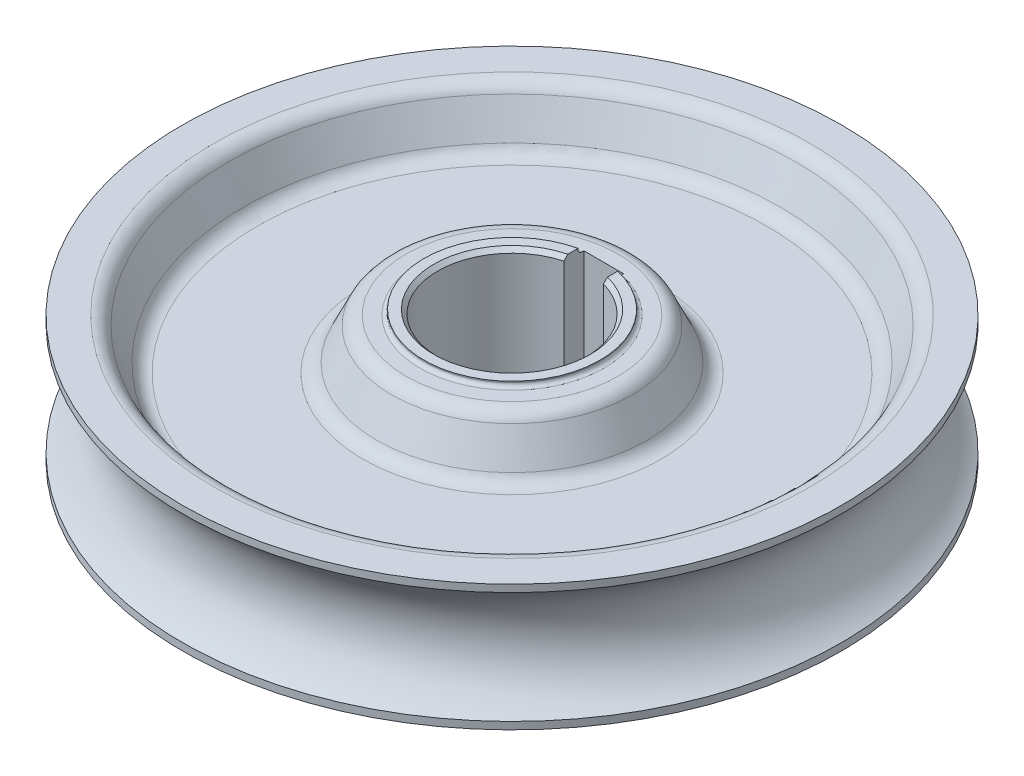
ISO-10303-21;
HEADER;
FILE_DESCRIPTION(('STEP AP214'),'2;1');
FILE_NAME('part.step','',(''),(''),'','','');
FILE_SCHEMA(('AUTOMOTIVE_DESIGN { 1 0 10303 214 1 1 1 1 }'));
ENDSEC;
DATA;
#1=APPLICATION_CONTEXT('core data for automotive mechanical design processes');
#2=APPLICATION_PROTOCOL_DEFINITION('international standard','automotive_design',2000,#1);
#3=PRODUCT_CONTEXT('',#1,'mechanical');
#4=PRODUCT('Part','Part','',(#3));
#5=PRODUCT_RELATED_PRODUCT_CATEGORY('part','',(#4));
#6=PRODUCT_DEFINITION_FORMATION('','',#4);
#7=PRODUCT_DEFINITION_CONTEXT('part definition',#1,'design');
#8=PRODUCT_DEFINITION('design','',#6,#7);
#9=PRODUCT_DEFINITION_SHAPE('','',#8);
#10=(LENGTH_UNIT() NAMED_UNIT(*) SI_UNIT(.MILLI.,.METRE.));
#11=(NAMED_UNIT(*) PLANE_ANGLE_UNIT() SI_UNIT($,.RADIAN.));
#12=(NAMED_UNIT(*) SI_UNIT($,.STERADIAN.) SOLID_ANGLE_UNIT());
#13=UNCERTAINTY_MEASURE_WITH_UNIT(LENGTH_MEASURE(1.E-05),#10,'distance_accuracy_value','');
#14=(GEOMETRIC_REPRESENTATION_CONTEXT(3) GLOBAL_UNCERTAINTY_ASSIGNED_CONTEXT((#13)) GLOBAL_UNIT_ASSIGNED_CONTEXT((#10,
#11,#12)) REPRESENTATION_CONTEXT('',''));
#15=CARTESIAN_POINT('',(0.,0.,0.));
#16=DIRECTION('',(0.,0.,1.));
#17=DIRECTION('',(1.,0.,0.));
#18=AXIS2_PLACEMENT_3D('',#15,#16,#17);
#19=CARTESIAN_POINT('',(-4.,-13.75,-18.5));
#20=DIRECTION('',(-1.,0.,0.));
#21=DIRECTION('',(0.,0.,1.));
#22=AXIS2_PLACEMENT_3D('',#19,#20,#21);
#23=PLANE('',#22);
#24=DIRECTION('',(0.,0.,-1.));
#25=VECTOR('',#24,1.);
#26=CARTESIAN_POINT('',(-4.,12.734,-18.5));
#27=LINE('',#26,#25);
#28=CARTESIAN_POINT('',(-4.,12.734,-18.1379212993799));
#29=VERTEX_POINT('',#28);
#30=CARTESIAN_POINT('',(-4.,12.734,-18.5));
#31=VERTEX_POINT('',#30);
#32=EDGE_CURVE('E397',#29,#31,#27,.T.);
#33=ORIENTED_EDGE('',*,*,#32,.F.);
#34=CARTESIAN_POINT('',(-4.,12.734,-18.1379212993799));
#35=CARTESIAN_POINT('',(-4.,12.7339661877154,-18.0913173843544));
#36=CARTESIAN_POINT('',(-4.,12.7379122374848,-18.0447197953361));
#37=CARTESIAN_POINT('',(-4.,12.7535123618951,-17.9528377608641));
#38=CARTESIAN_POINT('',(-4.,12.765165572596,-17.9075531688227));
#39=CARTESIAN_POINT('',(-4.,12.7959387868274,-17.8195569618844));
#40=CARTESIAN_POINT('',(-4.,12.8150638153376,-17.7768471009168));
#41=CARTESIAN_POINT('',(-4.,12.860277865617,-17.6953022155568));
#42=CARTESIAN_POINT('',(-4.,12.8863644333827,-17.6564658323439));
#43=CARTESIAN_POINT('',(-4.,12.9445144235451,-17.5842215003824));
#44=CARTESIAN_POINT('',(-4.,12.9765128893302,-17.5507613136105));
#45=CARTESIAN_POINT('',(-4.,13.0458027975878,-17.4898377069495));
#46=CARTESIAN_POINT('',(-4.,13.0830949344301,-17.4623750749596));
#47=CARTESIAN_POINT('',(-4.,13.1609716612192,-17.4149301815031));
#48=CARTESIAN_POINT('',(-4.,13.2014592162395,-17.3947884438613));
#49=CARTESIAN_POINT('',(-4.,13.285282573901,-17.3617872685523));
#50=CARTESIAN_POINT('',(-4.,13.3286155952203,-17.3489208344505));
#51=CARTESIAN_POINT('',(-4.,13.3982148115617,-17.3346902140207));
#52=CARTESIAN_POINT('',(-4.,13.4239832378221,-17.3307639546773));
#53=CARTESIAN_POINT('',(-4.,13.4757468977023,-17.3255268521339));
#54=CARTESIAN_POINT('',(-4.,13.5017417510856,-17.3242122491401));
#55=CARTESIAN_POINT('',(-4.,13.52775,-17.3242142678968));
#56=B_SPLINE_CURVE_WITH_KNOTS('',3,(#34,#35,#36,#37,#38,#39,#40,#41,#42,#43,#44,#45,#46,#47,#48,
#49,#50,#51,#52,#53,#54,#55),.UNSPECIFIED.,.F.,.F.,(4,2,2,2,2,2,2,2,2,2,4),(0.,
0.139637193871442,0.27925873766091,0.418974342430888,0.558640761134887,0.69685516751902,
0.835087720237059,0.970097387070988,1.10497699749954,1.18305483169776,1.26102018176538),.UNSPECIFIED.);
#57=CARTESIAN_POINT('',(-4.,13.52775,-17.3242142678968));
#58=VERTEX_POINT('',#57);
#59=EDGE_CURVE('E49',#29,#58,#56,.T.);
#60=ORIENTED_EDGE('',*,*,#59,.T.);
#61=DIRECTION('',(0.,1.,0.));
#62=VECTOR('',#61,1.);
#63=CARTESIAN_POINT('',(-4.,12.734,-17.3242142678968));
#64=LINE('',#63,#62);
#65=CARTESIAN_POINT('',(-4.,13.75,-17.3242142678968));
#66=VERTEX_POINT('',#65);
#67=EDGE_CURVE('E125',#58,#66,#64,.T.);
#68=ORIENTED_EDGE('',*,*,#67,.T.);
#69=DIRECTION('',(0.,0.,1.));
#70=VECTOR('',#69,1.);
#71=CARTESIAN_POINT('',(-4.,13.75,-18.5));
#72=LINE('',#71,#70);
#73=CARTESIAN_POINT('',(-4.,13.75,-15.2788264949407));
#74=VERTEX_POINT('',#73);
#75=EDGE_CURVE('E128',#66,#74,#72,.T.);
#76=ORIENTED_EDGE('',*,*,#75,.T.);
#77=CARTESIAN_POINT('',(-4.,25.0227829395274,-26.7693333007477));
#78=CARTESIAN_POINT('',(-4.,24.5122049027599,-26.2530825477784));
#79=CARTESIAN_POINT('',(-4.,24.0017855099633,-25.7366748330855));
#80=CARTESIAN_POINT('',(-4.,22.9813373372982,-24.7034730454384));
#81=CARTESIAN_POINT('',(-4.,22.4713085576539,-24.1866789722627));
#82=CARTESIAN_POINT('',(-4.,20.9419211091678,-22.6356115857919));
#83=CARTESIAN_POINT('',(-4.,19.9232592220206,-21.6006509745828));
#84=CARTESIAN_POINT('',(-4.,17.8889397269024,-19.5282290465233));
#85=CARTESIAN_POINT('',(-4.,16.8732815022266,-18.4907683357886));
#86=CARTESIAN_POINT('',(-4.,15.3531976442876,-16.9312449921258));
#87=CARTESIAN_POINT('',(-4.,14.847066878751,-16.410844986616));
#88=CARTESIAN_POINT('',(-4.,13.8363247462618,-15.368571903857));
#89=CARTESIAN_POINT('',(-4.,13.3317133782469,-14.8466988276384));
#90=CARTESIAN_POINT('',(-4.,12.2601311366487,-13.7341314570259));
#91=CARTESIAN_POINT('',(-4.,11.6934371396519,-13.1431700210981));
#92=CARTESIAN_POINT('',(-4.,10.8462733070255,-12.2540077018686));
#93=CARTESIAN_POINT('',(-4.,10.5643702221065,-11.95717257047));
#94=CARTESIAN_POINT('',(-4.,10.0017543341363,-11.3623729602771));
#95=CARTESIAN_POINT('',(-4.,9.72104153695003,-11.0644084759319));
#96=CARTESIAN_POINT('',(-4.,9.16106591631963,-10.4670305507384));
#97=CARTESIAN_POINT('',(-4.,8.88180332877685,-10.1676168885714));
#98=CARTESIAN_POINT('',(-4.,8.32519767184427,-9.56701695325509));
#99=CARTESIAN_POINT('',(-4.,8.04785457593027,-9.26583070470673));
#100=CARTESIAN_POINT('',(-4.,7.4956396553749,-8.66113040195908));
#101=CARTESIAN_POINT('',(-4.,7.22076812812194,-8.35761607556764));
#102=CARTESIAN_POINT('',(-4.,6.81099121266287,-7.90006510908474));
#103=CARTESIAN_POINT('',(-4.,6.67481745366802,-7.74716457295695));
#104=CARTESIAN_POINT('',(-4.,6.40347257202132,-7.44047340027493));
#105=CARTESIAN_POINT('',(-4.,6.26830146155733,-7.28668275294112));
#106=CARTESIAN_POINT('',(-4.,6.13371180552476,-7.13238260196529));
#107=B_SPLINE_CURVE_WITH_KNOTS('',3,(#77,#78,#79,#80,#81,#82,#83,#84,#85,#86,#87,#88,#89,#90,
#91,#92,#93,#94,#95,#96,#97,#98,#99,#100,#101,#102,#103,#104,#105,#106),.UNSPECIFIED.,.F.,.F.,
(4,2,2,2,2,2,2,2,2,2,2,2,2,2,4),(0.,2.17826605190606,4.35653335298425,8.71305896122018,
13.0686174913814,15.2464260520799,17.4242330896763,19.8805169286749,21.1086121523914,
22.3367134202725,23.5650085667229,24.7932867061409,26.0217107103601,26.6359516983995,
27.2502001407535),.UNSPECIFIED.);
#108=CARTESIAN_POINT('',(-4.,12.95625,-14.456832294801));
#109=VERTEX_POINT('',#108);
#110=EDGE_CURVE('E370',#74,#109,#107,.T.);
#111=ORIENTED_EDGE('',*,*,#110,.T.);
#112=DIRECTION('',(0.,-1.,0.));
#113=VECTOR('',#112,1.);
#114=CARTESIAN_POINT('',(-4.,0.,-14.456832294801));
#115=LINE('',#114,#113);
#116=CARTESIAN_POINT('',(-4.,-12.95625,-14.456832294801));
#117=VERTEX_POINT('',#116);
#118=EDGE_CURVE('E170',#109,#117,#115,.T.);
#119=ORIENTED_EDGE('',*,*,#118,.T.);
#120=CARTESIAN_POINT('',(-4.,-6.13371180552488,-7.13238260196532));
#121=CARTESIAN_POINT('',(-4.,-6.26830146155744,-7.28668275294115));
#122=CARTESIAN_POINT('',(-4.,-6.40347257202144,-7.44047340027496));
#123=CARTESIAN_POINT('',(-4.,-6.67481745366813,-7.74716457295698));
#124=CARTESIAN_POINT('',(-4.,-6.81099121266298,-7.90006510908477));
#125=CARTESIAN_POINT('',(-4.,-7.22076812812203,-8.35761607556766));
#126=CARTESIAN_POINT('',(-4.,-7.49563965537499,-8.6611304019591));
#127=CARTESIAN_POINT('',(-4.,-8.04785457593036,-9.26583070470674));
#128=CARTESIAN_POINT('',(-4.,-8.32519767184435,-9.5670169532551));
#129=CARTESIAN_POINT('',(-4.,-8.88180332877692,-10.1676168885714));
#130=CARTESIAN_POINT('',(-4.,-9.1610659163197,-10.4670305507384));
#131=CARTESIAN_POINT('',(-4.,-9.72104153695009,-11.0644084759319));
#132=CARTESIAN_POINT('',(-4.,-10.0017543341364,-11.3623729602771));
#133=CARTESIAN_POINT('',(-4.,-10.5643702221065,-11.95717257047));
#134=CARTESIAN_POINT('',(-4.,-10.8462733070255,-12.2540077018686));
#135=CARTESIAN_POINT('',(-4.,-11.6934371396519,-13.1431700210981));
#136=CARTESIAN_POINT('',(-4.,-12.2601311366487,-13.7341314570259));
#137=CARTESIAN_POINT('',(-4.,-13.3317133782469,-14.8466988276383));
#138=CARTESIAN_POINT('',(-4.,-13.8363247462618,-15.368571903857));
#139=CARTESIAN_POINT('',(-4.,-14.847066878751,-16.4108449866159));
#140=CARTESIAN_POINT('',(-4.,-15.3531976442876,-16.9312449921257));
#141=CARTESIAN_POINT('',(-4.,-16.8732815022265,-18.4907683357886));
#142=CARTESIAN_POINT('',(-4.,-17.8889397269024,-19.5282290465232));
#143=CARTESIAN_POINT('',(-4.,-19.9232592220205,-21.6006509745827));
#144=CARTESIAN_POINT('',(-4.,-20.9419211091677,-22.6356115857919));
#145=CARTESIAN_POINT('',(-4.,-22.4713085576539,-24.1866789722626));
#146=CARTESIAN_POINT('',(-4.,-22.9813373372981,-24.7034730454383));
#147=CARTESIAN_POINT('',(-4.,-24.0017855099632,-25.7366748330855));
#148=CARTESIAN_POINT('',(-4.,-24.5122049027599,-26.2530825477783));
#149=CARTESIAN_POINT('',(-4.,-25.0227829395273,-26.7693333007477));
#150=B_SPLINE_CURVE_WITH_KNOTS('',3,(#120,#121,#122,#123,#124,#125,#126,#127,#128,#129,#130,
#131,#132,#133,#134,#135,#136,#137,#138,#139,#140,#141,#142,#143,#144,#145,#146,#147,#148,#149),
.UNSPECIFIED.,.F.,.F.,(4,2,2,2,2,2,2,2,2,2,2,2,2,2,4),(0.,0.614248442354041,1.22848943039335,
2.45691343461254,3.68519157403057,4.9134867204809,6.14158798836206,7.36968321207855,
9.82596705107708,12.0037740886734,14.1815826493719,18.5371411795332,22.8936667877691,
25.0719340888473,27.2502001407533),.UNSPECIFIED.);
#151=CARTESIAN_POINT('',(-4.,-13.75,-15.2788264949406));
#152=VERTEX_POINT('',#151);
#153=EDGE_CURVE('E255',#117,#152,#150,.T.);
#154=ORIENTED_EDGE('',*,*,#153,.T.);
#155=DIRECTION('',(0.,0.,1.));
#156=VECTOR('',#155,1.);
#157=CARTESIAN_POINT('',(-4.,-13.75,-18.5));
#158=LINE('',#157,#156);
#159=CARTESIAN_POINT('',(-4.,-13.75,-17.3242142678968));
#160=VERTEX_POINT('',#159);
#161=EDGE_CURVE('E148',#160,#152,#158,.T.);
#162=ORIENTED_EDGE('',*,*,#161,.F.);
#163=DIRECTION('',(0.,-1.,0.));
#164=VECTOR('',#163,1.);
#165=CARTESIAN_POINT('',(-4.,-12.734,-17.3242142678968));
#166=LINE('',#165,#164);
#167=CARTESIAN_POINT('',(-4.,-13.52775,-17.3242142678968));
#168=VERTEX_POINT('',#167);
#169=EDGE_CURVE('E146',#168,#160,#166,.T.);
#170=ORIENTED_EDGE('',*,*,#169,.F.);
#171=CARTESIAN_POINT('',(-4.,-13.52775,-17.3242142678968));
#172=CARTESIAN_POINT('',(-4.,-13.4839109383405,-17.3241714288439));
#173=CARTESIAN_POINT('',(-4.,-13.4400902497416,-17.3279389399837));
#174=CARTESIAN_POINT('',(-4.,-13.3537674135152,-17.3427699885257));
#175=CARTESIAN_POINT('',(-4.,-13.3112633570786,-17.3538223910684));
#176=CARTESIAN_POINT('',(-4.,-13.2287054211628,-17.3829035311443));
#177=CARTESIAN_POINT('',(-4.,-13.1886520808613,-17.4009337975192));
#178=CARTESIAN_POINT('',(-4.,-13.1120939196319,-17.4433852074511));
#179=CARTESIAN_POINT('',(-4.,-13.0755892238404,-17.4678065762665));
#180=CARTESIAN_POINT('',(-4.,-13.0066909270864,-17.5226135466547));
#181=CARTESIAN_POINT('',(-4.,-12.9743488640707,-17.5530638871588));
#182=CARTESIAN_POINT('',(-4.,-12.9150841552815,-17.6188527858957));
#183=CARTESIAN_POINT('',(-4.,-12.8881628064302,-17.6541925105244));
#184=CARTESIAN_POINT('',(-4.,-12.8398186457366,-17.729664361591));
#185=CARTESIAN_POINT('',(-4.,-12.8185448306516,-17.7698918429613));
#186=CARTESIAN_POINT('',(-4.,-12.7828950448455,-17.8532900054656));
#187=CARTESIAN_POINT('',(-4.,-12.7685172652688,-17.8964599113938));
#188=CARTESIAN_POINT('',(-4.,-12.7498654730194,-17.9727929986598));
#189=CARTESIAN_POINT('',(-4.,-12.7439202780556,-18.0055587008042));
#190=CARTESIAN_POINT('',(-4.,-12.7359874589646,-18.0715197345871));
#191=CARTESIAN_POINT('',(-4.,-12.7339943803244,-18.104714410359));
#192=CARTESIAN_POINT('',(-4.,-12.734,-18.1379212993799));
#193=B_SPLINE_CURVE_WITH_KNOTS('',3,(#171,#172,#173,#174,#175,#176,#177,#178,#179,#180,#181,
#182,#183,#184,#185,#186,#187,#188,#189,#190,#191,#192),.UNSPECIFIED.,.F.,.F.,(4,2,2,2,2,2,2,2,
2,2,4),(0.,0.131327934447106,0.262455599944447,0.393612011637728,0.524773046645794,
0.657427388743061,0.790113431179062,0.926013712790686,1.0618783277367,1.16155334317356,
1.26109069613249),.UNSPECIFIED.);
#194=CARTESIAN_POINT('',(-4.,-12.734,-18.1379212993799));
#195=VERTEX_POINT('',#194);
#196=EDGE_CURVE('E203',#168,#195,#193,.T.);
#197=ORIENTED_EDGE('',*,*,#196,.T.);
#198=DIRECTION('',(0.,0.,1.));
#199=VECTOR('',#198,1.);
#200=CARTESIAN_POINT('',(-4.,-12.734,-18.5));
#201=LINE('',#200,#199);
#202=CARTESIAN_POINT('',(-4.,-12.734,-18.5));
#203=VERTEX_POINT('',#202);
#204=EDGE_CURVE('E322',#203,#195,#201,.T.);
#205=ORIENTED_EDGE('',*,*,#204,.F.);
#206=DIRECTION('',(0.,1.,0.));
#207=VECTOR('',#206,1.);
#208=CARTESIAN_POINT('',(-4.,-13.75,-18.5));
#209=LINE('',#208,#207);
#210=EDGE_CURVE('E156',#203,#31,#209,.T.);
#211=ORIENTED_EDGE('',*,*,#210,.T.);
#212=EDGE_LOOP('',(#33,#60,#68,#76,#111,#119,#154,#162,#170,#197,#205,#211));
#213=FACE_BOUND('',#212,.T.);
#214=ADVANCED_FACE('F36',(#213),#23,.F.);
#215=CARTESIAN_POINT('',(-4.,-13.75,-18.5));
#216=DIRECTION('',(0.,0.,-1.));
#217=DIRECTION('',(-1.,0.,0.));
#218=AXIS2_PLACEMENT_3D('',#215,#216,#217);
#219=PLANE('',#218);
#220=DIRECTION('',(1.,0.,0.));
#221=VECTOR('',#220,1.);
#222=CARTESIAN_POINT('',(-4.,12.734,-18.5));
#223=LINE('',#222,#221);
#224=CARTESIAN_POINT('',(4.,12.734,-18.5));
#225=VERTEX_POINT('',#224);
#226=EDGE_CURVE('E394',#31,#225,#223,.T.);
#227=ORIENTED_EDGE('',*,*,#226,.F.);
#228=ORIENTED_EDGE('',*,*,#210,.F.);
#229=DIRECTION('',(-1.,0.,0.));
#230=VECTOR('',#229,1.);
#231=CARTESIAN_POINT('',(-4.,-12.734,-18.5));
#232=LINE('',#231,#230);
#233=CARTESIAN_POINT('',(4.,-12.734,-18.5));
#234=VERTEX_POINT('',#233);
#235=EDGE_CURVE('E331',#234,#203,#232,.T.);
#236=ORIENTED_EDGE('',*,*,#235,.F.);
#237=DIRECTION('',(0.,1.,0.));
#238=VECTOR('',#237,1.);
#239=CARTESIAN_POINT('',(4.,-13.75,-18.5));
#240=LINE('',#239,#238);
#241=EDGE_CURVE('E160',#234,#225,#240,.T.);
#242=ORIENTED_EDGE('',*,*,#241,.T.);
#243=EDGE_LOOP('',(#227,#228,#236,#242));
#244=FACE_BOUND('',#243,.T.);
#245=ADVANCED_FACE('F182',(#244),#219,.F.);
#246=CARTESIAN_POINT('',(4.,-13.75,-18.5));
#247=DIRECTION('',(1.,0.,0.));
#248=DIRECTION('',(0.,0.,-1.));
#249=AXIS2_PLACEMENT_3D('',#246,#247,#248);
#250=PLANE('',#249);
#251=DIRECTION('',(0.,0.,1.));
#252=VECTOR('',#251,1.);
#253=CARTESIAN_POINT('',(4.,12.734,-18.5));
#254=LINE('',#253,#252);
#255=CARTESIAN_POINT('',(4.,12.734,-18.1379212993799));
#256=VERTEX_POINT('',#255);
#257=EDGE_CURVE('E398',#225,#256,#254,.T.);
#258=ORIENTED_EDGE('',*,*,#257,.F.);
#259=ORIENTED_EDGE('',*,*,#241,.F.);
#260=DIRECTION('',(0.,0.,-1.));
#261=VECTOR('',#260,1.);
#262=CARTESIAN_POINT('',(4.,-12.734,-18.5));
#263=LINE('',#262,#261);
#264=CARTESIAN_POINT('',(4.,-12.734,-18.1379212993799));
#265=VERTEX_POINT('',#264);
#266=EDGE_CURVE('E338',#265,#234,#263,.T.);
#267=ORIENTED_EDGE('',*,*,#266,.F.);
#268=CARTESIAN_POINT('',(4.,-12.734,-18.1379212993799));
#269=CARTESIAN_POINT('',(4.,-12.7339661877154,-18.0913173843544));
#270=CARTESIAN_POINT('',(4.,-12.7379122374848,-18.0447197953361));
#271=CARTESIAN_POINT('',(4.,-12.7535123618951,-17.9528377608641));
#272=CARTESIAN_POINT('',(4.,-12.765165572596,-17.9075531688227));
#273=CARTESIAN_POINT('',(4.,-12.7959387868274,-17.8195569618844));
#274=CARTESIAN_POINT('',(4.,-12.8150638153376,-17.7768471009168));
#275=CARTESIAN_POINT('',(4.,-12.860277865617,-17.6953022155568));
#276=CARTESIAN_POINT('',(4.,-12.8863644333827,-17.6564658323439));
#277=CARTESIAN_POINT('',(4.,-12.9445144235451,-17.5842215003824));
#278=CARTESIAN_POINT('',(4.,-12.9765128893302,-17.5507613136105));
#279=CARTESIAN_POINT('',(4.,-13.0458027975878,-17.4898377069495));
#280=CARTESIAN_POINT('',(4.,-13.0830949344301,-17.4623750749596));
#281=CARTESIAN_POINT('',(4.,-13.1609716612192,-17.4149301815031));
#282=CARTESIAN_POINT('',(4.,-13.2014592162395,-17.3947884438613));
#283=CARTESIAN_POINT('',(4.,-13.285282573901,-17.3617872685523));
#284=CARTESIAN_POINT('',(4.,-13.3286155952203,-17.3489208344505));
#285=CARTESIAN_POINT('',(4.,-13.3982148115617,-17.3346902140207));
#286=CARTESIAN_POINT('',(4.,-13.4239832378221,-17.3307639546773));
#287=CARTESIAN_POINT('',(4.,-13.4757468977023,-17.3255268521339));
#288=CARTESIAN_POINT('',(4.,-13.5017417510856,-17.3242122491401));
#289=CARTESIAN_POINT('',(4.,-13.52775,-17.3242142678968));
#290=B_SPLINE_CURVE_WITH_KNOTS('',3,(#268,#269,#270,#271,#272,#273,#274,#275,#276,#277,#278,
#279,#280,#281,#282,#283,#284,#285,#286,#287,#288,#289),.UNSPECIFIED.,.F.,.F.,(4,2,2,2,2,2,2,2,
2,2,4),(0.,0.139637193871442,0.27925873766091,0.418974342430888,0.558640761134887,
0.69685516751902,0.835087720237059,0.970097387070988,1.10497699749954,1.18305483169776,
1.26102018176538),.UNSPECIFIED.);
#291=CARTESIAN_POINT('',(4.,-13.52775,-17.3242142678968));
#292=VERTEX_POINT('',#291);
#293=EDGE_CURVE('E198',#265,#292,#290,.T.);
#294=ORIENTED_EDGE('',*,*,#293,.T.);
#295=DIRECTION('',(0.,-1.,0.));
#296=VECTOR('',#295,1.);
#297=CARTESIAN_POINT('',(4.,-12.734,-17.3242142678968));
#298=LINE('',#297,#296);
#299=CARTESIAN_POINT('',(4.,-13.75,-17.3242142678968));
#300=VERTEX_POINT('',#299);
#301=EDGE_CURVE('E261',#300,#292,#298,.F.);
#302=ORIENTED_EDGE('',*,*,#301,.F.);
#303=DIRECTION('',(0.,0.,-1.));
#304=VECTOR('',#303,1.);
#305=CARTESIAN_POINT('',(4.,-13.75,-18.5));
#306=LINE('',#305,#304);
#307=CARTESIAN_POINT('',(4.,-13.75,-15.2788264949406));
#308=VERTEX_POINT('',#307);
#309=EDGE_CURVE('E153',#308,#300,#306,.T.);
#310=ORIENTED_EDGE('',*,*,#309,.F.);
#311=CARTESIAN_POINT('',(4.,-25.0227829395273,-26.7693333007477));
#312=CARTESIAN_POINT('',(4.,-24.5122049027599,-26.2530825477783));
#313=CARTESIAN_POINT('',(4.,-24.0017855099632,-25.7366748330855));
#314=CARTESIAN_POINT('',(4.,-22.9813373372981,-24.7034730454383));
#315=CARTESIAN_POINT('',(4.,-22.4713085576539,-24.1866789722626));
#316=CARTESIAN_POINT('',(4.,-20.9419211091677,-22.6356115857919));
#317=CARTESIAN_POINT('',(4.,-19.9232592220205,-21.6006509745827));
#318=CARTESIAN_POINT('',(4.,-17.8889397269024,-19.5282290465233));
#319=CARTESIAN_POINT('',(4.,-16.8732815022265,-18.4907683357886));
#320=CARTESIAN_POINT('',(4.,-15.3531976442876,-16.9312449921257));
#321=CARTESIAN_POINT('',(4.,-14.847066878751,-16.4108449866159));
#322=CARTESIAN_POINT('',(4.,-13.8363247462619,-15.368571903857));
#323=CARTESIAN_POINT('',(4.,-13.3317133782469,-14.8466988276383));
#324=CARTESIAN_POINT('',(4.,-12.2601311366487,-13.7341314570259));
#325=CARTESIAN_POINT('',(4.,-11.6934371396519,-13.1431700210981));
#326=CARTESIAN_POINT('',(4.,-10.8462733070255,-12.2540077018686));
#327=CARTESIAN_POINT('',(4.,-10.5643702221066,-11.95717257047));
#328=CARTESIAN_POINT('',(4.,-10.0017543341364,-11.3623729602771));
#329=CARTESIAN_POINT('',(4.,-9.72104153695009,-11.0644084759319));
#330=CARTESIAN_POINT('',(4.,-9.1610659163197,-10.4670305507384));
#331=CARTESIAN_POINT('',(4.,-8.88180332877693,-10.1676168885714));
#332=CARTESIAN_POINT('',(4.,-8.32519767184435,-9.5670169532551));
#333=CARTESIAN_POINT('',(4.,-8.04785457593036,-9.26583070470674));
#334=CARTESIAN_POINT('',(4.,-7.49563965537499,-8.6611304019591));
#335=CARTESIAN_POINT('',(4.,-7.22076812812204,-8.35761607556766));
#336=CARTESIAN_POINT('',(4.,-6.81099121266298,-7.90006510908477));
#337=CARTESIAN_POINT('',(4.,-6.67481745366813,-7.74716457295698));
#338=CARTESIAN_POINT('',(4.,-6.40347257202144,-7.44047340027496));
#339=CARTESIAN_POINT('',(4.,-6.26830146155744,-7.28668275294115));
#340=CARTESIAN_POINT('',(4.,-6.13371180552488,-7.13238260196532));
#341=B_SPLINE_CURVE_WITH_KNOTS('',3,(#311,#312,#313,#314,#315,#316,#317,#318,#319,#320,#321,
#322,#323,#324,#325,#326,#327,#328,#329,#330,#331,#332,#333,#334,#335,#336,#337,#338,#339,#340),
.UNSPECIFIED.,.F.,.F.,(4,2,2,2,2,2,2,2,2,2,2,2,2,2,4),(0.,2.17826605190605,4.35653335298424,
8.71305896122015,13.0686174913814,15.2464260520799,17.4242330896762,19.8805169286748,
21.1086121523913,22.3367134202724,23.5650085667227,24.7932867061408,26.02171071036,
26.6359516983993,27.2502001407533),.UNSPECIFIED.);
#342=CARTESIAN_POINT('',(4.,-12.95625,-14.456832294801));
#343=VERTEX_POINT('',#342);
#344=EDGE_CURVE('E190',#308,#343,#341,.T.);
#345=ORIENTED_EDGE('',*,*,#344,.T.);
#346=DIRECTION('',(0.,-1.,0.));
#347=VECTOR('',#346,1.);
#348=CARTESIAN_POINT('',(4.,0.,-14.456832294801));
#349=LINE('',#348,#347);
#350=CARTESIAN_POINT('',(4.,12.95625,-14.456832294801));
#351=VERTEX_POINT('',#350);
#352=EDGE_CURVE('E159',#343,#351,#349,.F.);
#353=ORIENTED_EDGE('',*,*,#352,.T.);
#354=CARTESIAN_POINT('',(4.,6.13371180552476,-7.13238260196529));
#355=CARTESIAN_POINT('',(4.,6.26830146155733,-7.28668275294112));
#356=CARTESIAN_POINT('',(4.,6.40347257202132,-7.44047340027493));
#357=CARTESIAN_POINT('',(4.,6.67481745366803,-7.74716457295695));
#358=CARTESIAN_POINT('',(4.,6.81099121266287,-7.90006510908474));
#359=CARTESIAN_POINT('',(4.,7.22076812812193,-8.35761607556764));
#360=CARTESIAN_POINT('',(4.,7.4956396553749,-8.66113040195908));
#361=CARTESIAN_POINT('',(4.,8.04785457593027,-9.26583070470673));
#362=CARTESIAN_POINT('',(4.,8.32519767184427,-9.56701695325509));
#363=CARTESIAN_POINT('',(4.,8.88180332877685,-10.1676168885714));
#364=CARTESIAN_POINT('',(4.,9.16106591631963,-10.4670305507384));
#365=CARTESIAN_POINT('',(4.,9.72104153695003,-11.0644084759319));
#366=CARTESIAN_POINT('',(4.,10.0017543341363,-11.3623729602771));
#367=CARTESIAN_POINT('',(4.,10.5643702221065,-11.95717257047));
#368=CARTESIAN_POINT('',(4.,10.8462733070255,-12.2540077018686));
#369=CARTESIAN_POINT('',(4.,11.6934371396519,-13.1431700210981));
#370=CARTESIAN_POINT('',(4.,12.2601311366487,-13.7341314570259));
#371=CARTESIAN_POINT('',(4.,13.3317133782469,-14.8466988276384));
#372=CARTESIAN_POINT('',(4.,13.8363247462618,-15.368571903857));
#373=CARTESIAN_POINT('',(4.,14.847066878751,-16.410844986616));
#374=CARTESIAN_POINT('',(4.,15.3531976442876,-16.9312449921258));
#375=CARTESIAN_POINT('',(4.,16.8732815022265,-18.4907683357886));
#376=CARTESIAN_POINT('',(4.,17.8889397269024,-19.5282290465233));
#377=CARTESIAN_POINT('',(4.,19.9232592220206,-21.6006509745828));
#378=CARTESIAN_POINT('',(4.,20.9419211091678,-22.6356115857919));
#379=CARTESIAN_POINT('',(4.,22.4713085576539,-24.1866789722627));
#380=CARTESIAN_POINT('',(4.,22.9813373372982,-24.7034730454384));
#381=CARTESIAN_POINT('',(4.,24.0017855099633,-25.7366748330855));
#382=CARTESIAN_POINT('',(4.,24.5122049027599,-26.2530825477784));
#383=CARTESIAN_POINT('',(4.,25.0227829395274,-26.7693333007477));
#384=B_SPLINE_CURVE_WITH_KNOTS('',3,(#354,#355,#356,#357,#358,#359,#360,#361,#362,#363,#364,
#365,#366,#367,#368,#369,#370,#371,#372,#373,#374,#375,#376,#377,#378,#379,#380,#381,#382,#383),
.UNSPECIFIED.,.F.,.F.,(4,2,2,2,2,2,2,2,2,2,2,2,2,2,4),(0.,0.614248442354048,1.22848943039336,
2.45691343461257,3.68519157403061,4.91348672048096,6.14158798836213,7.36968321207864,
9.82596705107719,12.0037740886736,14.1815826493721,18.5371411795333,22.8936667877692,
25.0719340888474,27.2502001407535),.UNSPECIFIED.);
#385=CARTESIAN_POINT('',(4.,13.75,-15.2788264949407));
#386=VERTEX_POINT('',#385);
#387=EDGE_CURVE('E164',#351,#386,#384,.T.);
#388=ORIENTED_EDGE('',*,*,#387,.T.);
#389=DIRECTION('',(0.,0.,-1.));
#390=VECTOR('',#389,1.);
#391=CARTESIAN_POINT('',(4.,13.75,-18.5));
#392=LINE('',#391,#390);
#393=CARTESIAN_POINT('',(4.,13.75,-17.3242142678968));
#394=VERTEX_POINT('',#393);
#395=EDGE_CURVE('E145',#386,#394,#392,.T.);
#396=ORIENTED_EDGE('',*,*,#395,.T.);
#397=DIRECTION('',(0.,1.,0.));
#398=VECTOR('',#397,1.);
#399=CARTESIAN_POINT('',(4.,12.734,-17.3242142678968));
#400=LINE('',#399,#398);
#401=CARTESIAN_POINT('',(4.,13.52775,-17.3242142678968));
#402=VERTEX_POINT('',#401);
#403=EDGE_CURVE('E131',#394,#402,#400,.F.);
#404=ORIENTED_EDGE('',*,*,#403,.T.);
#405=CARTESIAN_POINT('',(4.,13.52775,-17.3242142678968));
#406=CARTESIAN_POINT('',(4.,13.4839109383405,-17.3241714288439));
#407=CARTESIAN_POINT('',(4.,13.4400902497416,-17.3279389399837));
#408=CARTESIAN_POINT('',(4.,13.3537674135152,-17.3427699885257));
#409=CARTESIAN_POINT('',(4.,13.3112633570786,-17.3538223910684));
#410=CARTESIAN_POINT('',(4.,13.2287054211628,-17.3829035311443));
#411=CARTESIAN_POINT('',(4.,13.1886520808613,-17.4009337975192));
#412=CARTESIAN_POINT('',(4.,13.1120939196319,-17.4433852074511));
#413=CARTESIAN_POINT('',(4.,13.0755892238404,-17.4678065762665));
#414=CARTESIAN_POINT('',(4.,13.0066909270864,-17.5226135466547));
#415=CARTESIAN_POINT('',(4.,12.9743488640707,-17.5530638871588));
#416=CARTESIAN_POINT('',(4.,12.9150841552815,-17.6188527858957));
#417=CARTESIAN_POINT('',(4.,12.8881628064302,-17.6541925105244));
#418=CARTESIAN_POINT('',(4.,12.8398186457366,-17.729664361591));
#419=CARTESIAN_POINT('',(4.,12.8185448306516,-17.7698918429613));
#420=CARTESIAN_POINT('',(4.,12.7828950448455,-17.8532900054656));
#421=CARTESIAN_POINT('',(4.,12.7685172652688,-17.8964599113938));
#422=CARTESIAN_POINT('',(4.,12.7498654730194,-17.9727929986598));
#423=CARTESIAN_POINT('',(4.,12.7439202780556,-18.0055587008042));
#424=CARTESIAN_POINT('',(4.,12.7359874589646,-18.0715197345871));
#425=CARTESIAN_POINT('',(4.,12.7339943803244,-18.104714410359));
#426=CARTESIAN_POINT('',(4.,12.734,-18.1379212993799));
#427=B_SPLINE_CURVE_WITH_KNOTS('',3,(#405,#406,#407,#408,#409,#410,#411,#412,#413,#414,#415,
#416,#417,#418,#419,#420,#421,#422,#423,#424,#425,#426),.UNSPECIFIED.,.F.,.F.,(4,2,2,2,2,2,2,2,
2,2,4),(0.,0.131327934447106,0.262455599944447,0.393612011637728,0.524773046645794,
0.657427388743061,0.790113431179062,0.926013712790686,1.0618783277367,1.16155334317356,
1.26109069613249),.UNSPECIFIED.);
#428=EDGE_CURVE('E13',#402,#256,#427,.T.);
#429=ORIENTED_EDGE('',*,*,#428,.T.);
#430=EDGE_LOOP('',(#258,#259,#267,#294,#302,#310,#345,#353,#388,#396,#404,#429));
#431=FACE_BOUND('',#430,.T.);
#432=ADVANCED_FACE('F176',(#431),#250,.F.);
#433=CARTESIAN_POINT('',(0.,0.,0.));
#434=DIRECTION('',(0.,-1.,0.));
#435=DIRECTION('',(0.,0.,-1.));
#436=AXIS2_PLACEMENT_3D('',#433,#434,#435);
#437=CYLINDRICAL_SURFACE('',#436,66.51625);
#438=CARTESIAN_POINT('',(0.,11.2600648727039,0.));
#439=DIRECTION('',(0.,-1.,0.));
#440=DIRECTION('',(0.,0.,-1.));
#441=AXIS2_PLACEMENT_3D('',#438,#439,#440);
#442=CIRCLE('',#441,66.51625);
#443=CARTESIAN_POINT('',(0.,11.2600648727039,-66.51625));
#444=VERTEX_POINT('',#443);
#445=EDGE_CURVE('E368',#444,#444,#442,.T.);
#446=ORIENTED_EDGE('',*,*,#445,.F.);
#447=EDGE_LOOP('',(#446));
#448=FACE_BOUND('',#447,.T.);
#449=CARTESIAN_POINT('',(0.,12.734,0.));
#450=DIRECTION('',(0.,1.,0.));
#451=DIRECTION('',(0.,0.,1.));
#452=AXIS2_PLACEMENT_3D('',#449,#450,#451);
#453=CIRCLE('',#452,66.51625);
#454=CARTESIAN_POINT('',(0.,12.734,66.51625));
#455=VERTEX_POINT('',#454);
#456=EDGE_CURVE('E139',#455,#455,#453,.F.);
#457=ORIENTED_EDGE('',*,*,#456,.T.);
#458=EDGE_LOOP('',(#457));
#459=FACE_BOUND('',#458,.T.);
#460=ADVANCED_FACE('F181',(#448,#459),#437,.T.);
#461=CARTESIAN_POINT('',(0.,-13.75,-15.));
#462=DIRECTION('',(0.,-1.,0.));
#463=DIRECTION('',(0.,0.,-1.));
#464=AXIS2_PLACEMENT_3D('',#461,#462,#463);
#465=PLANE('',#464);
#466=ORIENTED_EDGE('',*,*,#309,.T.);
#467=CARTESIAN_POINT('',(0.,-13.75,0.));
#468=DIRECTION('',(0.,-1.,0.));
#469=DIRECTION('',(0.,0.,-1.));
#470=AXIS2_PLACEMENT_3D('',#467,#468,#469);
#471=CIRCLE('',#470,17.78);
#472=EDGE_CURVE('E130',#300,#160,#471,.T.);
#473=ORIENTED_EDGE('',*,*,#472,.T.);
#474=ORIENTED_EDGE('',*,*,#161,.T.);
#475=CARTESIAN_POINT('',(0.,-13.75,0.));
#476=DIRECTION('',(0.,-1.,0.));
#477=DIRECTION('',(0.,0.,-1.));
#478=AXIS2_PLACEMENT_3D('',#475,#476,#477);
#479=CIRCLE('',#478,15.79375);
#480=EDGE_CURVE('E352',#152,#308,#479,.F.);
#481=ORIENTED_EDGE('',*,*,#480,.T.);
#482=EDGE_LOOP('',(#466,#473,#474,#481));
#483=FACE_BOUND('',#482,.T.);
#484=ADVANCED_FACE('F350',(#483),#465,.T.);
#485=CARTESIAN_POINT('',(0.,0.,0.));
#486=DIRECTION('',(0.,-1.,0.));
#487=DIRECTION('',(0.,0.,-1.));
#488=AXIS2_PLACEMENT_3D('',#485,#486,#487);
#489=CYLINDRICAL_SURFACE('',#488,66.51625);
#490=CARTESIAN_POINT('',(0.,-11.2600648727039,0.));
#491=DIRECTION('',(0.,-1.,0.));
#492=DIRECTION('',(0.,0.,-1.));
#493=AXIS2_PLACEMENT_3D('',#490,#491,#492);
#494=CIRCLE('',#493,66.51625);
#495=CARTESIAN_POINT('',(0.,-11.2600648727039,-66.51625));
#496=VERTEX_POINT('',#495);
#497=EDGE_CURVE('E365',#496,#496,#494,.T.);
#498=ORIENTED_EDGE('',*,*,#497,.T.);
#499=EDGE_LOOP('',(#498));
#500=FACE_BOUND('',#499,.T.);
#501=CARTESIAN_POINT('',(0.,-12.734,0.));
#502=DIRECTION('',(0.,-1.,0.));
#503=DIRECTION('',(0.,0.,-1.));
#504=AXIS2_PLACEMENT_3D('',#501,#502,#503);
#505=CIRCLE('',#504,66.51625);
#506=CARTESIAN_POINT('',(0.,-12.734,-66.51625));
#507=VERTEX_POINT('',#506);
#508=EDGE_CURVE('E150',#507,#507,#505,.F.);
#509=ORIENTED_EDGE('',*,*,#508,.T.);
#510=EDGE_LOOP('',(#509));
#511=FACE_BOUND('',#510,.T.);
#512=ADVANCED_FACE('F547',(#500,#511),#489,.T.);
#513=CARTESIAN_POINT('',(0.,13.75,-66.51625));
#514=DIRECTION('',(0.,1.,0.));
#515=DIRECTION('',(0.,0.,1.));
#516=AXIS2_PLACEMENT_3D('',#513,#514,#515);
#517=PLANE('',#516);
#518=CARTESIAN_POINT('',(0.,13.75,0.));
#519=DIRECTION('',(0.,-1.,0.));
#520=DIRECTION('',(0.,0.,-1.));
#521=AXIS2_PLACEMENT_3D('',#518,#519,#520);
#522=CIRCLE('',#521,17.78);
#523=EDGE_CURVE('E134',#394,#66,#522,.T.);
#524=ORIENTED_EDGE('',*,*,#523,.F.);
#525=ORIENTED_EDGE('',*,*,#395,.F.);
#526=CARTESIAN_POINT('',(0.,13.75,0.));
#527=DIRECTION('',(0.,1.,0.));
#528=DIRECTION('',(0.,0.,1.));
#529=AXIS2_PLACEMENT_3D('',#526,#527,#528);
#530=CIRCLE('',#529,15.79375);
#531=EDGE_CURVE('E144',#386,#74,#530,.F.);
#532=ORIENTED_EDGE('',*,*,#531,.T.);
#533=ORIENTED_EDGE('',*,*,#75,.F.);
#534=EDGE_LOOP('',(#524,#525,#532,#533));
#535=FACE_BOUND('',#534,.T.);
#536=ADVANCED_FACE('F142',(#535),#517,.T.);
#537=CARTESIAN_POINT('',(0.,0.,0.));
#538=DIRECTION('',(0.,-1.,0.));
#539=DIRECTION('',(0.,0.,-1.));
#540=AXIS2_PLACEMENT_3D('',#537,#538,#539);
#541=TOROIDAL_SURFACE('',#540,73.66,13.335);
#542=ORIENTED_EDGE('',*,*,#445,.T.);
#543=EDGE_LOOP('',(#542));
#544=FACE_BOUND('',#543,.T.);
#545=ORIENTED_EDGE('',*,*,#497,.F.);
#546=EDGE_LOOP('',(#545));
#547=FACE_BOUND('',#546,.T.);
#548=ADVANCED_FACE('F384',(#544,#547),#541,.F.);
#549=CARTESIAN_POINT('',(0.,0.,0.));
#550=DIRECTION('',(0.,-1.,0.));
#551=DIRECTION('',(0.,0.,-1.));
#552=AXIS2_PLACEMENT_3D('',#549,#550,#551);
#553=CYLINDRICAL_SURFACE('',#552,15.);
#554=ORIENTED_EDGE('',*,*,#118,.F.);
#555=CARTESIAN_POINT('',(0.,12.95625,0.));
#556=DIRECTION('',(0.,1.,0.));
#557=DIRECTION('',(0.,0.,1.));
#558=AXIS2_PLACEMENT_3D('',#555,#556,#557);
#559=CIRCLE('',#558,15.);
#560=EDGE_CURVE('E359',#109,#351,#559,.T.);
#561=ORIENTED_EDGE('',*,*,#560,.T.);
#562=ORIENTED_EDGE('',*,*,#352,.F.);
#563=CARTESIAN_POINT('',(0.,-12.95625,0.));
#564=DIRECTION('',(0.,-1.,0.));
#565=DIRECTION('',(0.,0.,-1.));
#566=AXIS2_PLACEMENT_3D('',#563,#564,#565);
#567=CIRCLE('',#566,15.);
#568=EDGE_CURVE('E358',#343,#117,#567,.T.);
#569=ORIENTED_EDGE('',*,*,#568,.T.);
#570=EDGE_LOOP('',(#554,#561,#562,#569));
#571=FACE_BOUND('',#570,.T.);
#572=ADVANCED_FACE('F377',(#571),#553,.F.);
#573=CARTESIAN_POINT('',(0.,13.75,0.));
#574=DIRECTION('',(0.,1.,0.));
#575=DIRECTION('',(0.,0.,1.));
#576=AXIS2_PLACEMENT_3D('',#573,#574,#575);
#577=CONICAL_SURFACE('',#576,15.79375,0.785398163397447);
#578=ORIENTED_EDGE('',*,*,#110,.F.);
#579=ORIENTED_EDGE('',*,*,#531,.F.);
#580=ORIENTED_EDGE('',*,*,#387,.F.);
#581=ORIENTED_EDGE('',*,*,#560,.F.);
#582=EDGE_LOOP('',(#578,#579,#580,#581));
#583=FACE_BOUND('',#582,.T.);
#584=ADVANCED_FACE('F172',(#583),#577,.F.);
#585=CARTESIAN_POINT('',(0.,-12.95625,0.));
#586=DIRECTION('',(0.,-1.,0.));
#587=DIRECTION('',(0.,0.,-1.));
#588=AXIS2_PLACEMENT_3D('',#585,#586,#587);
#589=CONICAL_SURFACE('',#588,15.,0.78539816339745);
#590=ORIENTED_EDGE('',*,*,#153,.F.);
#591=ORIENTED_EDGE('',*,*,#568,.F.);
#592=ORIENTED_EDGE('',*,*,#344,.F.);
#593=ORIENTED_EDGE('',*,*,#480,.F.);
#594=EDGE_LOOP('',(#590,#591,#592,#593));
#595=FACE_BOUND('',#594,.T.);
#596=ADVANCED_FACE('F249',(#595),#589,.F.);
#597=CARTESIAN_POINT('',(0.,-12.734,0.));
#598=DIRECTION('',(0.,-1.,0.));
#599=DIRECTION('',(0.,0.,-1.));
#600=AXIS2_PLACEMENT_3D('',#597,#598,#599);
#601=PLANE('',#600);
#602=CARTESIAN_POINT('',(0.,-12.734,0.));
#603=DIRECTION('',(0.,-1.,0.));
#604=DIRECTION('',(0.,0.,-1.));
#605=AXIS2_PLACEMENT_3D('',#602,#603,#604);
#606=CIRCLE('',#605,60.1276794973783);
#607=CARTESIAN_POINT('',(0.,-12.734,-60.1276794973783));
#608=VERTEX_POINT('',#607);
#609=EDGE_CURVE('E309',#608,#608,#606,.F.);
#610=ORIENTED_EDGE('',*,*,#609,.T.);
#611=EDGE_LOOP('',(#610));
#612=FACE_BOUND('',#611,.T.);
#613=ORIENTED_EDGE('',*,*,#508,.F.);
#614=EDGE_LOOP('',(#613));
#615=FACE_BOUND('',#614,.T.);
#616=ADVANCED_FACE('F252',(#612,#615),#601,.T.);
#617=CARTESIAN_POINT('',(0.,-12.734,0.));
#618=DIRECTION('',(0.,-1.,0.));
#619=DIRECTION('',(0.,0.,-1.));
#620=AXIS2_PLACEMENT_3D('',#617,#618,#619);
#621=CYLINDRICAL_SURFACE('',#620,17.78);
#622=ORIENTED_EDGE('',*,*,#301,.T.);
#623=CARTESIAN_POINT('',(0.,-13.52775,0.));
#624=DIRECTION('',(0.,-1.,0.));
#625=DIRECTION('',(0.,0.,-1.));
#626=AXIS2_PLACEMENT_3D('',#623,#624,#625);
#627=CIRCLE('',#626,17.78);
#628=EDGE_CURVE('E312',#292,#168,#627,.T.);
#629=ORIENTED_EDGE('',*,*,#628,.T.);
#630=ORIENTED_EDGE('',*,*,#169,.T.);
#631=ORIENTED_EDGE('',*,*,#472,.F.);
#632=EDGE_LOOP('',(#622,#629,#630,#631));
#633=FACE_BOUND('',#632,.T.);
#634=ADVANCED_FACE('F340',(#633),#621,.T.);
#635=CARTESIAN_POINT('',(0.,-12.734,0.));
#636=DIRECTION('',(0.,-1.,0.));
#637=DIRECTION('',(0.,0.,-1.));
#638=AXIS2_PLACEMENT_3D('',#635,#636,#637);
#639=CIRCLE('',#638,21.3885705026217);
#640=CARTESIAN_POINT('',(0.,-12.734,-21.3885705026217));
#641=VERTEX_POINT('',#640);
#642=EDGE_CURVE('E279',#641,#641,#639,.T.);
#643=ORIENTED_EDGE('',*,*,#642,.T.);
#644=EDGE_LOOP('',(#643));
#645=FACE_BOUND('',#644,.T.);
#646=ORIENTED_EDGE('',*,*,#204,.T.);
#647=CARTESIAN_POINT('',(0.,-12.734,0.));
#648=DIRECTION('',(0.,-1.,0.));
#649=DIRECTION('',(0.,0.,-1.));
#650=AXIS2_PLACEMENT_3D('',#647,#648,#649);
#651=CIRCLE('',#650,18.57375);
#652=EDGE_CURVE('E315',#195,#265,#651,.F.);
#653=ORIENTED_EDGE('',*,*,#652,.T.);
#654=ORIENTED_EDGE('',*,*,#266,.T.);
#655=ORIENTED_EDGE('',*,*,#235,.T.);
#656=EDGE_LOOP('',(#646,#653,#654,#655));
#657=FACE_BOUND('',#656,.T.);
#658=ADVANCED_FACE('F328',(#645,#657),#601,.T.);
#659=CARTESIAN_POINT('',(0.,-2.6375,0.));
#660=DIRECTION('',(0.,1.,0.));
#661=DIRECTION('',(0.,0.,1.));
#662=AXIS2_PLACEMENT_3D('',#659,#660,#661);
#663=CONICAL_SURFACE('',#662,28.1193438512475,0.436332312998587);
#664=CARTESIAN_POINT('',(0.,-10.9008129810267,0.));
#665=DIRECTION('',(0.,-1.,0.));
#666=DIRECTION('',(0.,0.,-1.));
#667=AXIS2_PLACEMENT_3D('',#664,#665,#666);
#668=CIRCLE('',#667,24.2660977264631);
#669=CARTESIAN_POINT('',(0.,-10.9008129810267,-24.2660977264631));
#670=VERTEX_POINT('',#669);
#671=EDGE_CURVE('E276',#670,#670,#668,.F.);
#672=ORIENTED_EDGE('',*,*,#671,.T.);
#673=EDGE_LOOP('',(#672));
#674=FACE_BOUND('',#673,.T.);
#675=CARTESIAN_POINT('',(0.,-4.47068701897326,0.));
#676=DIRECTION('',(0.,1.,0.));
#677=DIRECTION('',(0.,0.,1.));
#678=AXIS2_PLACEMENT_3D('',#675,#676,#677);
#679=CIRCLE('',#678,27.2645147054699);
#680=CARTESIAN_POINT('',(0.,-4.47068701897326,27.2645147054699));
#681=VERTEX_POINT('',#680);
#682=EDGE_CURVE('E273',#681,#681,#679,.F.);
#683=ORIENTED_EDGE('',*,*,#682,.T.);
#684=EDGE_LOOP('',(#683));
#685=FACE_BOUND('',#684,.T.);
#686=ADVANCED_FACE('F515',(#674,#685),#663,.T.);
#687=CARTESIAN_POINT('',(0.,-2.6375,-28.1193438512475));
#688=DIRECTION('',(0.,-1.,0.));
#689=DIRECTION('',(0.,0.,-1.));
#690=AXIS2_PLACEMENT_3D('',#687,#688,#689);
#691=PLANE('',#690);
#692=CARTESIAN_POINT('',(0.,-2.6375,0.));
#693=DIRECTION('',(0.,-1.,0.));
#694=DIRECTION('',(0.,0.,-1.));
#695=AXIS2_PLACEMENT_3D('',#692,#693,#694);
#696=CIRCLE('',#695,30.1420419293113);
#697=CARTESIAN_POINT('',(0.,-2.6375,-30.1420419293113));
#698=VERTEX_POINT('',#697);
#699=EDGE_CURVE('E300',#698,#698,#696,.F.);
#700=ORIENTED_EDGE('',*,*,#699,.T.);
#701=EDGE_LOOP('',(#700));
#702=FACE_BOUND('',#701,.T.);
#703=CARTESIAN_POINT('',(0.,-2.6375,0.));
#704=DIRECTION('',(0.,-1.,0.));
#705=DIRECTION('',(0.,0.,-1.));
#706=AXIS2_PLACEMENT_3D('',#703,#704,#705);
#707=CIRCLE('',#706,51.3742080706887);
#708=CARTESIAN_POINT('',(0.,-2.6375,-51.3742080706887));
#709=VERTEX_POINT('',#708);
#710=EDGE_CURVE('E297',#709,#709,#707,.T.);
#711=ORIENTED_EDGE('',*,*,#710,.T.);
#712=EDGE_LOOP('',(#711));
#713=FACE_BOUND('',#712,.T.);
#714=ADVANCED_FACE('F418',(#702,#713),#691,.T.);
#715=CARTESIAN_POINT('',(0.,-13.75,0.));
#716=DIRECTION('',(0.,-1.,0.));
#717=DIRECTION('',(0.,0.,-1.));
#718=AXIS2_PLACEMENT_3D('',#715,#716,#717);
#719=CONICAL_SURFACE('',#718,58.57875,0.436332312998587);
#720=CARTESIAN_POINT('',(0.,-4.47068701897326,0.));
#721=DIRECTION('',(0.,-1.,0.));
#722=DIRECTION('',(0.,0.,-1.));
#723=AXIS2_PLACEMENT_3D('',#720,#721,#722);
#724=CIRCLE('',#723,54.2517352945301);
#725=CARTESIAN_POINT('',(0.,-4.47068701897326,-54.2517352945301));
#726=VERTEX_POINT('',#725);
#727=EDGE_CURVE('E306',#726,#726,#724,.F.);
#728=ORIENTED_EDGE('',*,*,#727,.T.);
#729=EDGE_LOOP('',(#728));
#730=FACE_BOUND('',#729,.T.);
#731=CARTESIAN_POINT('',(0.,-10.9008129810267,0.));
#732=DIRECTION('',(0.,1.,0.));
#733=DIRECTION('',(0.,0.,1.));
#734=AXIS2_PLACEMENT_3D('',#731,#732,#733);
#735=CIRCLE('',#734,57.2501522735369);
#736=CARTESIAN_POINT('',(0.,-10.9008129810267,57.2501522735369));
#737=VERTEX_POINT('',#736);
#738=EDGE_CURVE('E303',#737,#737,#735,.F.);
#739=ORIENTED_EDGE('',*,*,#738,.T.);
#740=EDGE_LOOP('',(#739));
#741=FACE_BOUND('',#740,.T.);
#742=ADVANCED_FACE('F409',(#730,#741),#719,.F.);
#743=CARTESIAN_POINT('',(0.,12.734,0.));
#744=DIRECTION('',(0.,1.,0.));
#745=DIRECTION('',(0.,0.,1.));
#746=AXIS2_PLACEMENT_3D('',#743,#744,#745);
#747=PLANE('',#746);
#748=CARTESIAN_POINT('',(0.,12.734,0.));
#749=DIRECTION('',(0.,1.,0.));
#750=DIRECTION('',(0.,0.,1.));
#751=AXIS2_PLACEMENT_3D('',#748,#749,#750);
#752=CIRCLE('',#751,60.1276794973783);
#753=CARTESIAN_POINT('',(0.,12.734,60.1276794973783));
#754=VERTEX_POINT('',#753);
#755=EDGE_CURVE('E294',#754,#754,#752,.F.);
#756=ORIENTED_EDGE('',*,*,#755,.T.);
#757=EDGE_LOOP('',(#756));
#758=FACE_BOUND('',#757,.T.);
#759=ORIENTED_EDGE('',*,*,#456,.F.);
#760=EDGE_LOOP('',(#759));
#761=FACE_BOUND('',#760,.T.);
#762=ADVANCED_FACE('F407',(#758,#761),#747,.T.);
#763=CARTESIAN_POINT('',(0.,12.734,0.));
#764=DIRECTION('',(0.,1.,0.));
#765=DIRECTION('',(0.,0.,1.));
#766=AXIS2_PLACEMENT_3D('',#763,#764,#765);
#767=CYLINDRICAL_SURFACE('',#766,17.78);
#768=ORIENTED_EDGE('',*,*,#67,.F.);
#769=CARTESIAN_POINT('',(0.,13.52775,0.));
#770=DIRECTION('',(0.,1.,0.));
#771=DIRECTION('',(0.,0.,1.));
#772=AXIS2_PLACEMENT_3D('',#769,#770,#771);
#773=CIRCLE('',#772,17.78);
#774=EDGE_CURVE('E62',#58,#402,#773,.T.);
#775=ORIENTED_EDGE('',*,*,#774,.T.);
#776=ORIENTED_EDGE('',*,*,#403,.F.);
#777=ORIENTED_EDGE('',*,*,#523,.T.);
#778=EDGE_LOOP('',(#768,#775,#776,#777));
#779=FACE_BOUND('',#778,.T.);
#780=ADVANCED_FACE('F135',(#779),#767,.T.);
#781=CARTESIAN_POINT('',(0.,12.734,0.));
#782=DIRECTION('',(0.,1.,0.));
#783=DIRECTION('',(0.,0.,1.));
#784=AXIS2_PLACEMENT_3D('',#781,#782,#783);
#785=CIRCLE('',#784,21.3885705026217);
#786=CARTESIAN_POINT('',(0.,12.734,21.3885705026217));
#787=VERTEX_POINT('',#786);
#788=EDGE_CURVE('E270',#787,#787,#785,.T.);
#789=ORIENTED_EDGE('',*,*,#788,.T.);
#790=EDGE_LOOP('',(#789));
#791=FACE_BOUND('',#790,.T.);
#792=ORIENTED_EDGE('',*,*,#257,.T.);
#793=CARTESIAN_POINT('',(0.,12.734,0.));
#794=DIRECTION('',(0.,1.,0.));
#795=DIRECTION('',(0.,0.,1.));
#796=AXIS2_PLACEMENT_3D('',#793,#794,#795);
#797=CIRCLE('',#796,18.57375);
#798=EDGE_CURVE('E317',#256,#29,#797,.F.);
#799=ORIENTED_EDGE('',*,*,#798,.T.);
#800=ORIENTED_EDGE('',*,*,#32,.T.);
#801=ORIENTED_EDGE('',*,*,#226,.T.);
#802=EDGE_LOOP('',(#792,#799,#800,#801));
#803=FACE_BOUND('',#802,.T.);
#804=ADVANCED_FACE('F412',(#791,#803),#747,.T.);
#805=CARTESIAN_POINT('',(0.,2.6375,0.));
#806=DIRECTION('',(0.,-1.,0.));
#807=DIRECTION('',(0.,0.,1.));
#808=AXIS2_PLACEMENT_3D('',#805,#806,#807);
#809=CONICAL_SURFACE('',#808,28.1193438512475,0.436332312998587);
#810=CARTESIAN_POINT('',(0.,10.9008129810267,0.));
#811=DIRECTION('',(0.,1.,0.));
#812=DIRECTION('',(0.,0.,1.));
#813=AXIS2_PLACEMENT_3D('',#810,#811,#812);
#814=CIRCLE('',#813,24.2660977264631);
#815=CARTESIAN_POINT('',(0.,10.9008129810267,24.2660977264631));
#816=VERTEX_POINT('',#815);
#817=EDGE_CURVE('E267',#816,#816,#814,.F.);
#818=ORIENTED_EDGE('',*,*,#817,.T.);
#819=EDGE_LOOP('',(#818));
#820=FACE_BOUND('',#819,.T.);
#821=CARTESIAN_POINT('',(0.,4.47068701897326,0.));
#822=DIRECTION('',(0.,-1.,0.));
#823=DIRECTION('',(0.,0.,-1.));
#824=AXIS2_PLACEMENT_3D('',#821,#822,#823);
#825=CIRCLE('',#824,27.2645147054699);
#826=CARTESIAN_POINT('',(0.,4.47068701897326,-27.2645147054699));
#827=VERTEX_POINT('',#826);
#828=EDGE_CURVE('E264',#827,#827,#825,.F.);
#829=ORIENTED_EDGE('',*,*,#828,.T.);
#830=EDGE_LOOP('',(#829));
#831=FACE_BOUND('',#830,.T.);
#832=ADVANCED_FACE('F423',(#820,#831),#809,.T.);
#833=CARTESIAN_POINT('',(0.,2.6375,-28.1193438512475));
#834=DIRECTION('',(0.,1.,0.));
#835=DIRECTION('',(0.,0.,-1.));
#836=AXIS2_PLACEMENT_3D('',#833,#834,#835);
#837=PLANE('',#836);
#838=CARTESIAN_POINT('',(0.,2.6375,0.));
#839=DIRECTION('',(0.,1.,0.));
#840=DIRECTION('',(0.,0.,1.));
#841=AXIS2_PLACEMENT_3D('',#838,#839,#840);
#842=CIRCLE('',#841,30.1420419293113);
#843=CARTESIAN_POINT('',(0.,2.6375,30.1420419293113));
#844=VERTEX_POINT('',#843);
#845=EDGE_CURVE('E285',#844,#844,#842,.F.);
#846=ORIENTED_EDGE('',*,*,#845,.T.);
#847=EDGE_LOOP('',(#846));
#848=FACE_BOUND('',#847,.T.);
#849=CARTESIAN_POINT('',(0.,2.6375,0.));
#850=DIRECTION('',(0.,1.,0.));
#851=DIRECTION('',(0.,0.,1.));
#852=AXIS2_PLACEMENT_3D('',#849,#850,#851);
#853=CIRCLE('',#852,51.3742080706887);
#854=CARTESIAN_POINT('',(0.,2.6375,51.3742080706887));
#855=VERTEX_POINT('',#854);
#856=EDGE_CURVE('E282',#855,#855,#853,.T.);
#857=ORIENTED_EDGE('',*,*,#856,.T.);
#858=EDGE_LOOP('',(#857));
#859=FACE_BOUND('',#858,.T.);
#860=ADVANCED_FACE('F428',(#848,#859),#837,.T.);
#861=CARTESIAN_POINT('',(0.,13.75,0.));
#862=DIRECTION('',(0.,1.,0.));
#863=DIRECTION('',(0.,0.,-1.));
#864=AXIS2_PLACEMENT_3D('',#861,#862,#863);
#865=CONICAL_SURFACE('',#864,58.57875,0.436332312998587);
#866=CARTESIAN_POINT('',(0.,4.47068701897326,0.));
#867=DIRECTION('',(0.,1.,0.));
#868=DIRECTION('',(0.,0.,1.));
#869=AXIS2_PLACEMENT_3D('',#866,#867,#868);
#870=CIRCLE('',#869,54.2517352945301);
#871=CARTESIAN_POINT('',(0.,4.47068701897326,54.2517352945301));
#872=VERTEX_POINT('',#871);
#873=EDGE_CURVE('E291',#872,#872,#870,.F.);
#874=ORIENTED_EDGE('',*,*,#873,.T.);
#875=EDGE_LOOP('',(#874));
#876=FACE_BOUND('',#875,.T.);
#877=CARTESIAN_POINT('',(0.,10.9008129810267,0.));
#878=DIRECTION('',(0.,-1.,0.));
#879=DIRECTION('',(0.,0.,-1.));
#880=AXIS2_PLACEMENT_3D('',#877,#878,#879);
#881=CIRCLE('',#880,57.2501522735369);
#882=CARTESIAN_POINT('',(0.,10.9008129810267,-57.2501522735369));
#883=VERTEX_POINT('',#882);
#884=EDGE_CURVE('E288',#883,#883,#881,.F.);
#885=ORIENTED_EDGE('',*,*,#884,.T.);
#886=EDGE_LOOP('',(#885));
#887=FACE_BOUND('',#886,.T.);
#888=ADVANCED_FACE('F247',(#876,#887),#865,.F.);
#889=CARTESIAN_POINT('',(0.,9.559,0.));
#890=DIRECTION('',(0.,1.,0.));
#891=DIRECTION('',(0.,0.,1.));
#892=AXIS2_PLACEMENT_3D('',#889,#890,#891);
#893=TOROIDAL_SURFACE('',#892,21.3885705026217,3.175);
#894=ORIENTED_EDGE('',*,*,#788,.F.);
#895=EDGE_LOOP('',(#894));
#896=FACE_BOUND('',#895,.T.);
#897=ORIENTED_EDGE('',*,*,#817,.F.);
#898=EDGE_LOOP('',(#897));
#899=FACE_BOUND('',#898,.T.);
#900=ADVANCED_FACE('F244',(#896,#899),#893,.T.);
#901=CARTESIAN_POINT('',(0.,-9.559,0.));
#902=DIRECTION('',(0.,-1.,0.));
#903=DIRECTION('',(0.,0.,-1.));
#904=AXIS2_PLACEMENT_3D('',#901,#902,#903);
#905=TOROIDAL_SURFACE('',#904,21.3885705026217,3.175);
#906=ORIENTED_EDGE('',*,*,#642,.F.);
#907=EDGE_LOOP('',(#906));
#908=FACE_BOUND('',#907,.T.);
#909=ORIENTED_EDGE('',*,*,#671,.F.);
#910=EDGE_LOOP('',(#909));
#911=FACE_BOUND('',#910,.T.);
#912=ADVANCED_FACE('F240',(#908,#911),#905,.T.);
#913=CARTESIAN_POINT('',(0.,5.8125,0.));
#914=DIRECTION('',(0.,1.,0.));
#915=DIRECTION('',(0.,0.,1.));
#916=AXIS2_PLACEMENT_3D('',#913,#914,#915);
#917=TOROIDAL_SURFACE('',#916,30.1420419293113,3.175);
#918=ORIENTED_EDGE('',*,*,#845,.F.);
#919=EDGE_LOOP('',(#918));
#920=FACE_BOUND('',#919,.T.);
#921=ORIENTED_EDGE('',*,*,#828,.F.);
#922=EDGE_LOOP('',(#921));
#923=FACE_BOUND('',#922,.T.);
#924=ADVANCED_FACE('F236',(#920,#923),#917,.F.);
#925=CARTESIAN_POINT('',(0.,5.8125,0.));
#926=DIRECTION('',(0.,1.,0.));
#927=DIRECTION('',(0.,0.,1.));
#928=AXIS2_PLACEMENT_3D('',#925,#926,#927);
#929=TOROIDAL_SURFACE('',#928,51.3742080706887,3.175);
#930=ORIENTED_EDGE('',*,*,#873,.F.);
#931=EDGE_LOOP('',(#930));
#932=FACE_BOUND('',#931,.T.);
#933=ORIENTED_EDGE('',*,*,#856,.F.);
#934=EDGE_LOOP('',(#933));
#935=FACE_BOUND('',#934,.T.);
#936=ADVANCED_FACE('F232',(#932,#935),#929,.F.);
#937=CARTESIAN_POINT('',(0.,9.559,0.));
#938=DIRECTION('',(0.,1.,0.));
#939=DIRECTION('',(0.,0.,1.));
#940=AXIS2_PLACEMENT_3D('',#937,#938,#939);
#941=TOROIDAL_SURFACE('',#940,60.1276794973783,3.175);
#942=ORIENTED_EDGE('',*,*,#755,.F.);
#943=EDGE_LOOP('',(#942));
#944=FACE_BOUND('',#943,.T.);
#945=ORIENTED_EDGE('',*,*,#884,.F.);
#946=EDGE_LOOP('',(#945));
#947=FACE_BOUND('',#946,.T.);
#948=ADVANCED_FACE('F228',(#944,#947),#941,.T.);
#949=CARTESIAN_POINT('',(0.,-5.8125,0.));
#950=DIRECTION('',(0.,-1.,0.));
#951=DIRECTION('',(0.,0.,-1.));
#952=AXIS2_PLACEMENT_3D('',#949,#950,#951);
#953=TOROIDAL_SURFACE('',#952,30.1420419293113,3.175);
#954=ORIENTED_EDGE('',*,*,#682,.F.);
#955=EDGE_LOOP('',(#954));
#956=FACE_BOUND('',#955,.T.);
#957=ORIENTED_EDGE('',*,*,#699,.F.);
#958=EDGE_LOOP('',(#957));
#959=FACE_BOUND('',#958,.T.);
#960=ADVANCED_FACE('F224',(#956,#959),#953,.F.);
#961=CARTESIAN_POINT('',(0.,-5.8125,0.));
#962=DIRECTION('',(0.,-1.,0.));
#963=DIRECTION('',(0.,0.,-1.));
#964=AXIS2_PLACEMENT_3D('',#961,#962,#963);
#965=TOROIDAL_SURFACE('',#964,51.3742080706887,3.175);
#966=ORIENTED_EDGE('',*,*,#710,.F.);
#967=EDGE_LOOP('',(#966));
#968=FACE_BOUND('',#967,.T.);
#969=ORIENTED_EDGE('',*,*,#727,.F.);
#970=EDGE_LOOP('',(#969));
#971=FACE_BOUND('',#970,.T.);
#972=ADVANCED_FACE('F220',(#968,#971),#965,.F.);
#973=CARTESIAN_POINT('',(0.,-9.559,0.));
#974=DIRECTION('',(0.,-1.,0.));
#975=DIRECTION('',(0.,0.,-1.));
#976=AXIS2_PLACEMENT_3D('',#973,#974,#975);
#977=TOROIDAL_SURFACE('',#976,60.1276794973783,3.175);
#978=ORIENTED_EDGE('',*,*,#609,.F.);
#979=EDGE_LOOP('',(#978));
#980=FACE_BOUND('',#979,.T.);
#981=ORIENTED_EDGE('',*,*,#738,.F.);
#982=EDGE_LOOP('',(#981));
#983=FACE_BOUND('',#982,.T.);
#984=ADVANCED_FACE('F215',(#980,#983),#977,.T.);
#985=CARTESIAN_POINT('',(0.,-13.52775,0.));
#986=DIRECTION('',(0.,-1.,0.));
#987=DIRECTION('',(0.,0.,-1.));
#988=AXIS2_PLACEMENT_3D('',#985,#986,#987);
#989=TOROIDAL_SURFACE('',#988,18.57375,0.79375);
#990=ORIENTED_EDGE('',*,*,#293,.F.);
#991=ORIENTED_EDGE('',*,*,#652,.F.);
#992=ORIENTED_EDGE('',*,*,#196,.F.);
#993=ORIENTED_EDGE('',*,*,#628,.F.);
#994=EDGE_LOOP('',(#990,#991,#992,#993));
#995=FACE_BOUND('',#994,.T.);
#996=ADVANCED_FACE('F211',(#995),#989,.F.);
#997=CARTESIAN_POINT('',(0.,13.52775,0.));
#998=DIRECTION('',(0.,1.,0.));
#999=DIRECTION('',(0.,0.,1.));
#1000=AXIS2_PLACEMENT_3D('',#997,#998,#999);
#1001=TOROIDAL_SURFACE('',#1000,18.57375,0.79375);
#1002=ORIENTED_EDGE('',*,*,#428,.F.);
#1003=ORIENTED_EDGE('',*,*,#774,.F.);
#1004=ORIENTED_EDGE('',*,*,#59,.F.);
#1005=ORIENTED_EDGE('',*,*,#798,.F.);
#1006=EDGE_LOOP('',(#1002,#1003,#1004,#1005));
#1007=FACE_BOUND('',#1006,.T.);
#1008=ADVANCED_FACE('F38',(#1007),#1001,.F.);
#1009=CLOSED_SHELL('',(#214,#245,#432,#460,#484,#512,#536,#548,#572,#584,#596,#616,#634,#658,
#686,#714,#742,#762,#780,#804,#832,#860,#888,#900,#912,#924,#936,#948,#960,#972,#984,#996,#1008));
#1010=MANIFOLD_SOLID_BREP('B2',#1009);
#1011=ADVANCED_BREP_SHAPE_REPRESENTATION('',(#18,#1010),#14);
#1012=SHAPE_DEFINITION_REPRESENTATION(#9,#1011);
ENDSEC;
END-ISO-10303-21;
